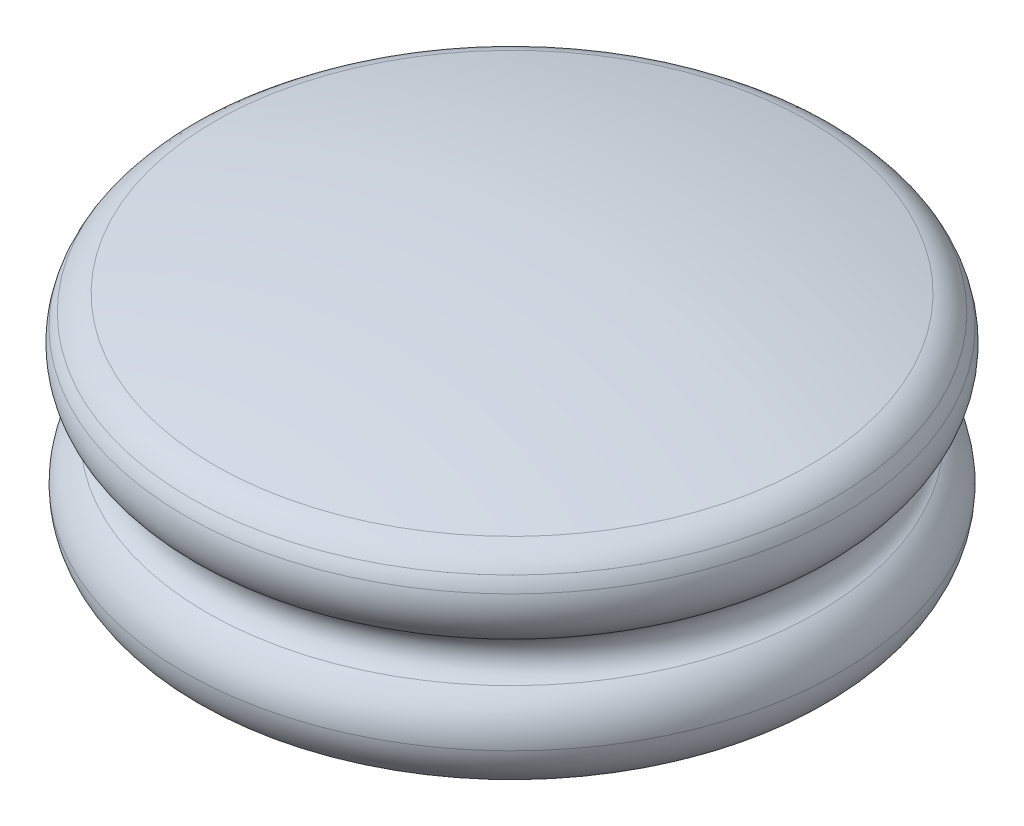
ISO-10303-21;
HEADER;
FILE_DESCRIPTION(('STEP AP214'),'2;1');
FILE_NAME('part.step','',(''),(''),'','','');
FILE_SCHEMA(('AUTOMOTIVE_DESIGN { 1 0 10303 214 1 1 1 1 }'));
ENDSEC;
DATA;
#1=APPLICATION_CONTEXT('core data for automotive mechanical design processes');
#2=APPLICATION_PROTOCOL_DEFINITION('international standard','automotive_design',2000,#1);
#3=PRODUCT_CONTEXT('',#1,'mechanical');
#4=PRODUCT('Part','Part','',(#3));
#5=PRODUCT_RELATED_PRODUCT_CATEGORY('part','',(#4));
#6=PRODUCT_DEFINITION_FORMATION('','',#4);
#7=PRODUCT_DEFINITION_CONTEXT('part definition',#1,'design');
#8=PRODUCT_DEFINITION('design','',#6,#7);
#9=PRODUCT_DEFINITION_SHAPE('','',#8);
#10=(LENGTH_UNIT() NAMED_UNIT(*) SI_UNIT(.MILLI.,.METRE.));
#11=(NAMED_UNIT(*) PLANE_ANGLE_UNIT() SI_UNIT($,.RADIAN.));
#12=(NAMED_UNIT(*) SI_UNIT($,.STERADIAN.) SOLID_ANGLE_UNIT());
#13=UNCERTAINTY_MEASURE_WITH_UNIT(LENGTH_MEASURE(1.E-05),#10,'distance_accuracy_value','');
#14=(GEOMETRIC_REPRESENTATION_CONTEXT(3) GLOBAL_UNCERTAINTY_ASSIGNED_CONTEXT((#13)) GLOBAL_UNIT_ASSIGNED_CONTEXT((#10,
#11,#12)) REPRESENTATION_CONTEXT('',''));
#15=CARTESIAN_POINT('',(0.,0.,0.));
#16=DIRECTION('',(0.,0.,1.));
#17=DIRECTION('',(1.,0.,0.));
#18=AXIS2_PLACEMENT_3D('',#15,#16,#17);
#19=CARTESIAN_POINT('',(0.,95.1362545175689,0.));
#20=DIRECTION('',(0.,1.,0.));
#21=DIRECTION('',(0.,0.,1.));
#22=AXIS2_PLACEMENT_3D('',#19,#20,#21);
#23=TOROIDAL_SURFACE('',#22,34.056135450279,6.18395613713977);
#24=CARTESIAN_POINT('',(0.,94.9999999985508,0.));
#25=DIRECTION('',(0.,1.,0.));
#26=DIRECTION('',(0.,0.,1.));
#27=AXIS2_PLACEMENT_3D('',#24,#25,#26);
#28=CIRCLE('',#27,40.2385903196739);
#29=CARTESIAN_POINT('',(0.,94.9999999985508,40.2385903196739));
#30=VERTEX_POINT('',#29);
#31=EDGE_CURVE('E10',#30,#30,#28,.T.);
#32=ORIENTED_EDGE('',*,*,#31,.F.);
#33=EDGE_LOOP('',(#32));
#34=FACE_BOUND('',#33,.T.);
#35=CARTESIAN_POINT('',(0.,90.,0.));
#36=DIRECTION('',(0.,1.,0.));
#37=DIRECTION('',(0.,0.,1.));
#38=AXIS2_PLACEMENT_3D('',#35,#36,#37);
#39=CIRCLE('',#38,37.5);
#40=CARTESIAN_POINT('',(0.,90.,37.5));
#41=VERTEX_POINT('',#40);
#42=EDGE_CURVE('E74',#41,#41,#39,.T.);
#43=ORIENTED_EDGE('',*,*,#42,.T.);
#44=EDGE_LOOP('',(#43));
#45=FACE_BOUND('',#44,.T.);
#46=ADVANCED_FACE('F43',(#34,#45),#23,.T.);
#47=CARTESIAN_POINT('',(0.,94.8806114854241,0.));
#48=DIRECTION('',(0.,1.,0.));
#49=DIRECTION('',(0.,0.,1.));
#50=AXIS2_PLACEMENT_3D('',#47,#48,#49);
#51=TOROIDAL_SURFACE('',#50,34.0869286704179,6.15282005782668);
#52=CARTESIAN_POINT('',(0.,100.,0.));
#53=DIRECTION('',(0.,1.,0.));
#54=DIRECTION('',(0.,0.,1.));
#55=AXIS2_PLACEMENT_3D('',#52,#53,#54);
#56=CIRCLE('',#55,37.5);
#57=CARTESIAN_POINT('',(0.,100.,37.5));
#58=VERTEX_POINT('',#57);
#59=EDGE_CURVE('E50',#58,#58,#56,.T.);
#60=ORIENTED_EDGE('',*,*,#59,.F.);
#61=EDGE_LOOP('',(#60));
#62=FACE_BOUND('',#61,.T.);
#63=ORIENTED_EDGE('',*,*,#31,.T.);
#64=EDGE_LOOP('',(#63));
#65=FACE_BOUND('',#64,.T.);
#66=ADVANCED_FACE('F91',(#62,#65),#51,.T.);
#67=CARTESIAN_POINT('',(0.,102.5,0.));
#68=DIRECTION('',(0.,1.,0.));
#69=DIRECTION('',(0.,0.,1.));
#70=AXIS2_PLACEMENT_3D('',#67,#68,#69);
#71=TOROIDAL_SURFACE('',#70,38.8325020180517,2.83294222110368);
#72=CARTESIAN_POINT('',(0.,105.,0.));
#73=DIRECTION('',(0.,1.,0.));
#74=DIRECTION('',(0.,0.,1.));
#75=AXIS2_PLACEMENT_3D('',#72,#73,#74);
#76=CIRCLE('',#75,37.5000000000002);
#77=CARTESIAN_POINT('',(0.,105.,37.5000000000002));
#78=VERTEX_POINT('',#77);
#79=EDGE_CURVE('E55',#78,#78,#76,.T.);
#80=ORIENTED_EDGE('',*,*,#79,.F.);
#81=EDGE_LOOP('',(#80));
#82=FACE_BOUND('',#81,.T.);
#83=ORIENTED_EDGE('',*,*,#59,.T.);
#84=EDGE_LOOP('',(#83));
#85=FACE_BOUND('',#84,.T.);
#86=ADVANCED_FACE('F96',(#82,#85),#71,.F.);
#87=CARTESIAN_POINT('',(0.,109.997234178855,0.));
#88=DIRECTION('',(0.,1.,0.));
#89=DIRECTION('',(0.,0.,1.));
#90=AXIS2_PLACEMENT_3D('',#87,#88,#89);
#91=TOROIDAL_SURFACE('',#90,34.8364701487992,5.66275027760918);
#92=CARTESIAN_POINT('',(0.,111.695420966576,0.));
#93=DIRECTION('',(0.,1.,0.));
#94=DIRECTION('',(0.,0.,1.));
#95=AXIS2_PLACEMENT_3D('',#92,#93,#94);
#96=CIRCLE('',#95,40.2385903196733);
#97=CARTESIAN_POINT('',(0.,111.695420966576,40.2385903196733));
#98=VERTEX_POINT('',#97);
#99=EDGE_CURVE('E60',#98,#98,#96,.T.);
#100=ORIENTED_EDGE('',*,*,#99,.F.);
#101=EDGE_LOOP('',(#100));
#102=FACE_BOUND('',#101,.T.);
#103=ORIENTED_EDGE('',*,*,#79,.T.);
#104=EDGE_LOOP('',(#103));
#105=FACE_BOUND('',#104,.T.);
#106=ADVANCED_FACE('F101',(#102,#105),#91,.T.);
#107=CARTESIAN_POINT('',(0.,109.992119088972,0.));
#108=DIRECTION('',(0.,1.,0.));
#109=DIRECTION('',(0.,0.,1.));
#110=AXIS2_PLACEMENT_3D('',#107,#108,#109);
#111=TOROIDAL_SURFACE('',#110,34.8201984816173,5.67980698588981);
#112=CARTESIAN_POINT('',(0.,113.192096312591,0.));
#113=DIRECTION('',(0.,1.,0.));
#114=DIRECTION('',(0.,0.,1.));
#115=AXIS2_PLACEMENT_3D('',#112,#113,#114);
#116=CIRCLE('',#115,39.5127833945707);
#117=CARTESIAN_POINT('',(0.,113.192096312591,39.5127833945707));
#118=VERTEX_POINT('',#117);
#119=EDGE_CURVE('E66',#118,#118,#116,.T.);
#120=ORIENTED_EDGE('',*,*,#119,.F.);
#121=EDGE_LOOP('',(#120));
#122=FACE_BOUND('',#121,.T.);
#123=ORIENTED_EDGE('',*,*,#99,.T.);
#124=EDGE_LOOP('',(#123));
#125=FACE_BOUND('',#124,.T.);
#126=ADVANCED_FACE('F107',(#122,#125),#111,.T.);
#127=CARTESIAN_POINT('',(0.,110.375119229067,0.));
#128=DIRECTION('',(0.,1.,0.));
#129=DIRECTION('',(0.,0.,1.));
#130=AXIS2_PLACEMENT_3D('',#127,#128,#129);
#131=TOROIDAL_SURFACE('',#130,35.3818464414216,4.99999999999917);
#132=CARTESIAN_POINT('',(0.,115.230275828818,0.));
#133=DIRECTION('',(0.,1.,0.));
#134=DIRECTION('',(0.,0.,1.));
#135=AXIS2_PLACEMENT_3D('',#132,#133,#134);
#136=CIRCLE('',#135,36.5766076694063);
#137=CARTESIAN_POINT('',(0.,115.230275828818,36.5766076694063));
#138=VERTEX_POINT('',#137);
#139=EDGE_CURVE('E70',#138,#138,#136,.T.);
#140=ORIENTED_EDGE('',*,*,#139,.F.);
#141=EDGE_LOOP('',(#140));
#142=FACE_BOUND('',#141,.T.);
#143=ORIENTED_EDGE('',*,*,#119,.T.);
#144=EDGE_LOOP('',(#143));
#145=FACE_BOUND('',#144,.T.);
#146=ADVANCED_FACE('F87',(#142,#145),#131,.T.);
#147=CARTESIAN_POINT('',(0.,-33.4062500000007,0.));
#148=DIRECTION('',(0.,1.,0.));
#149=DIRECTION('',(0.,0.,-1.));
#150=AXIS2_PLACEMENT_3D('',#147,#148,#149);
#151=SPHERICAL_SURFACE('',#150,153.070784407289);
#152=ORIENTED_EDGE('',*,*,#139,.T.);
#153=EDGE_LOOP('',(#152));
#154=FACE_BOUND('',#153,.T.);
#155=ADVANCED_FACE('F82',(#154),#151,.T.);
#156=CARTESIAN_POINT('',(0.,90.,0.));
#157=DIRECTION('',(0.,1.,0.));
#158=DIRECTION('',(0.,0.,1.));
#159=AXIS2_PLACEMENT_3D('',#156,#157,#158);
#160=PLANE('',#159);
#161=ORIENTED_EDGE('',*,*,#42,.F.);
#162=EDGE_LOOP('',(#161));
#163=FACE_BOUND('',#162,.T.);
#164=ADVANCED_FACE('F80',(#163),#160,.F.);
#165=CLOSED_SHELL('',(#46,#66,#86,#106,#126,#146,#155,#164));
#166=MANIFOLD_SOLID_BREP('B2',#165);
#167=ADVANCED_BREP_SHAPE_REPRESENTATION('',(#18,#166),#14);
#168=SHAPE_DEFINITION_REPRESENTATION(#9,#167);
ENDSEC;
END-ISO-10303-21;
